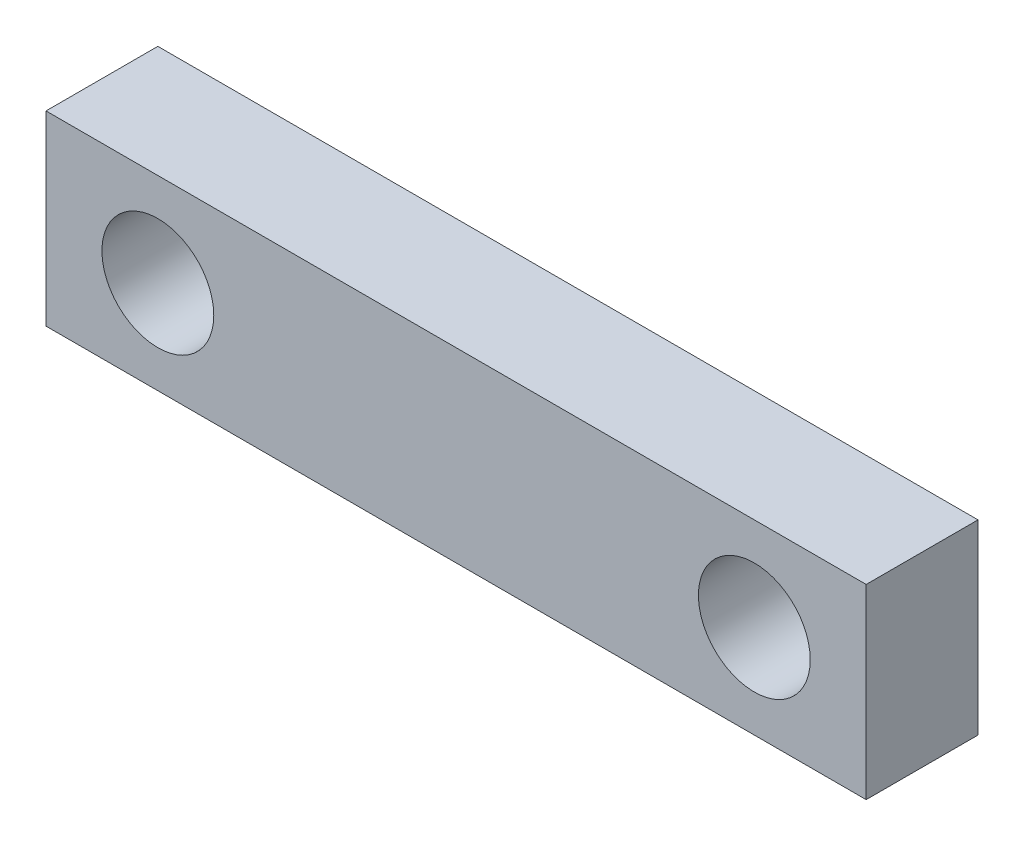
ISO-10303-21;
HEADER;
FILE_DESCRIPTION(('STEP AP214'),'2;1');
FILE_NAME('part.step','',(''),(''),'','','');
FILE_SCHEMA(('AUTOMOTIVE_DESIGN { 1 0 10303 214 1 1 1 1 }'));
ENDSEC;
DATA;
#1=APPLICATION_CONTEXT('core data for automotive mechanical design processes');
#2=APPLICATION_PROTOCOL_DEFINITION('international standard','automotive_design',2000,#1);
#3=PRODUCT_CONTEXT('',#1,'mechanical');
#4=PRODUCT('Part','Part','',(#3));
#5=PRODUCT_RELATED_PRODUCT_CATEGORY('part','',(#4));
#6=PRODUCT_DEFINITION_FORMATION('','',#4);
#7=PRODUCT_DEFINITION_CONTEXT('part definition',#1,'design');
#8=PRODUCT_DEFINITION('design','',#6,#7);
#9=PRODUCT_DEFINITION_SHAPE('','',#8);
#10=(LENGTH_UNIT() NAMED_UNIT(*) SI_UNIT(.MILLI.,.METRE.));
#11=(NAMED_UNIT(*) PLANE_ANGLE_UNIT() SI_UNIT($,.RADIAN.));
#12=(NAMED_UNIT(*) SI_UNIT($,.STERADIAN.) SOLID_ANGLE_UNIT());
#13=UNCERTAINTY_MEASURE_WITH_UNIT(LENGTH_MEASURE(1.E-05),#10,'distance_accuracy_value','');
#14=(GEOMETRIC_REPRESENTATION_CONTEXT(3) GLOBAL_UNCERTAINTY_ASSIGNED_CONTEXT((#13)) GLOBAL_UNIT_ASSIGNED_CONTEXT((#10,
#11,#12)) REPRESENTATION_CONTEXT('',''));
#15=CARTESIAN_POINT('',(0.,0.,0.));
#16=DIRECTION('',(0.,0.,1.));
#17=DIRECTION('',(1.,0.,0.));
#18=AXIS2_PLACEMENT_3D('',#15,#16,#17);
#19=CARTESIAN_POINT('',(0.,0.,15.));
#20=DIRECTION('',(1.,0.,0.));
#21=DIRECTION('',(0.,0.,-1.));
#22=AXIS2_PLACEMENT_3D('',#19,#20,#21);
#23=PLANE('',#22);
#24=DIRECTION('',(0.,-1.,0.));
#25=VECTOR('',#24,1.);
#26=CARTESIAN_POINT('',(0.,0.,0.));
#27=LINE('',#26,#25);
#28=CARTESIAN_POINT('',(0.,25.,0.));
#29=VERTEX_POINT('',#28);
#30=CARTESIAN_POINT('',(0.,0.,0.));
#31=VERTEX_POINT('',#30);
#32=EDGE_CURVE('E68',#29,#31,#27,.T.);
#33=ORIENTED_EDGE('',*,*,#32,.T.);
#34=DIRECTION('',(0.,0.,-1.));
#35=VECTOR('',#34,1.);
#36=CARTESIAN_POINT('',(0.,0.,15.));
#37=LINE('',#36,#35);
#38=CARTESIAN_POINT('',(0.,0.,15.));
#39=VERTEX_POINT('',#38);
#40=EDGE_CURVE('E11',#39,#31,#37,.T.);
#41=ORIENTED_EDGE('',*,*,#40,.F.);
#42=DIRECTION('',(0.,-1.,0.));
#43=VECTOR('',#42,1.);
#44=CARTESIAN_POINT('',(0.,0.,15.));
#45=LINE('',#44,#43);
#46=CARTESIAN_POINT('',(0.,25.,15.));
#47=VERTEX_POINT('',#46);
#48=EDGE_CURVE('E91',#47,#39,#45,.T.);
#49=ORIENTED_EDGE('',*,*,#48,.F.);
#50=DIRECTION('',(0.,0.,-1.));
#51=VECTOR('',#50,1.);
#52=CARTESIAN_POINT('',(0.,25.,15.));
#53=LINE('',#52,#51);
#54=EDGE_CURVE('E80',#47,#29,#53,.T.);
#55=ORIENTED_EDGE('',*,*,#54,.T.);
#56=EDGE_LOOP('',(#33,#41,#49,#55));
#57=FACE_BOUND('',#56,.T.);
#58=ADVANCED_FACE('F24',(#57),#23,.F.);
#59=CARTESIAN_POINT('',(0.,0.,15.));
#60=DIRECTION('',(0.,1.,0.));
#61=DIRECTION('',(0.,0.,1.));
#62=AXIS2_PLACEMENT_3D('',#59,#60,#61);
#63=PLANE('',#62);
#64=DIRECTION('',(1.,0.,0.));
#65=VECTOR('',#64,1.);
#66=CARTESIAN_POINT('',(0.,0.,0.));
#67=LINE('',#66,#65);
#68=CARTESIAN_POINT('',(110.,0.,0.));
#69=VERTEX_POINT('',#68);
#70=EDGE_CURVE('E64',#31,#69,#67,.T.);
#71=ORIENTED_EDGE('',*,*,#70,.T.);
#72=DIRECTION('',(0.,0.,-1.));
#73=VECTOR('',#72,1.);
#74=CARTESIAN_POINT('',(110.,0.,15.));
#75=LINE('',#74,#73);
#76=CARTESIAN_POINT('',(110.,0.,15.));
#77=VERTEX_POINT('',#76);
#78=EDGE_CURVE('E31',#77,#69,#75,.T.);
#79=ORIENTED_EDGE('',*,*,#78,.F.);
#80=DIRECTION('',(1.,0.,0.));
#81=VECTOR('',#80,1.);
#82=CARTESIAN_POINT('',(0.,0.,15.));
#83=LINE('',#82,#81);
#84=EDGE_CURVE('E76',#39,#77,#83,.T.);
#85=ORIENTED_EDGE('',*,*,#84,.F.);
#86=ORIENTED_EDGE('',*,*,#40,.T.);
#87=EDGE_LOOP('',(#71,#79,#85,#86));
#88=FACE_BOUND('',#87,.T.);
#89=ADVANCED_FACE('F75',(#88),#63,.F.);
#90=CARTESIAN_POINT('',(110.,0.,15.));
#91=DIRECTION('',(-1.,0.,0.));
#92=DIRECTION('',(0.,0.,1.));
#93=AXIS2_PLACEMENT_3D('',#90,#91,#92);
#94=PLANE('',#93);
#95=DIRECTION('',(0.,1.,0.));
#96=VECTOR('',#95,1.);
#97=CARTESIAN_POINT('',(110.,0.,0.));
#98=LINE('',#97,#96);
#99=CARTESIAN_POINT('',(110.,25.,0.));
#100=VERTEX_POINT('',#99);
#101=EDGE_CURVE('E69',#69,#100,#98,.T.);
#102=ORIENTED_EDGE('',*,*,#101,.T.);
#103=DIRECTION('',(0.,0.,-1.));
#104=VECTOR('',#103,1.);
#105=CARTESIAN_POINT('',(110.,25.,15.));
#106=LINE('',#105,#104);
#107=CARTESIAN_POINT('',(110.,25.,15.));
#108=VERTEX_POINT('',#107);
#109=EDGE_CURVE('E97',#108,#100,#106,.T.);
#110=ORIENTED_EDGE('',*,*,#109,.F.);
#111=DIRECTION('',(0.,1.,0.));
#112=VECTOR('',#111,1.);
#113=CARTESIAN_POINT('',(110.,0.,15.));
#114=LINE('',#113,#112);
#115=EDGE_CURVE('E43',#77,#108,#114,.T.);
#116=ORIENTED_EDGE('',*,*,#115,.F.);
#117=ORIENTED_EDGE('',*,*,#78,.T.);
#118=EDGE_LOOP('',(#102,#110,#116,#117));
#119=FACE_BOUND('',#118,.T.);
#120=ADVANCED_FACE('F100',(#119),#94,.F.);
#121=CARTESIAN_POINT('',(0.,25.,15.));
#122=DIRECTION('',(0.,-1.,0.));
#123=DIRECTION('',(0.,0.,-1.));
#124=AXIS2_PLACEMENT_3D('',#121,#122,#123);
#125=PLANE('',#124);
#126=DIRECTION('',(-1.,0.,0.));
#127=VECTOR('',#126,1.);
#128=CARTESIAN_POINT('',(0.,25.,0.));
#129=LINE('',#128,#127);
#130=EDGE_CURVE('E89',#100,#29,#129,.T.);
#131=ORIENTED_EDGE('',*,*,#130,.T.);
#132=ORIENTED_EDGE('',*,*,#54,.F.);
#133=DIRECTION('',(-1.,0.,0.));
#134=VECTOR('',#133,1.);
#135=CARTESIAN_POINT('',(0.,25.,15.));
#136=LINE('',#135,#134);
#137=EDGE_CURVE('E38',#108,#47,#136,.T.);
#138=ORIENTED_EDGE('',*,*,#137,.F.);
#139=ORIENTED_EDGE('',*,*,#109,.T.);
#140=EDGE_LOOP('',(#131,#132,#138,#139));
#141=FACE_BOUND('',#140,.T.);
#142=ADVANCED_FACE('F102',(#141),#125,.F.);
#143=CARTESIAN_POINT('',(0.,25.,15.));
#144=DIRECTION('',(0.,0.,-1.));
#145=DIRECTION('',(-1.,0.,0.));
#146=AXIS2_PLACEMENT_3D('',#143,#144,#145);
#147=PLANE('',#146);
#148=CARTESIAN_POINT('',(95.,12.5,15.));
#149=DIRECTION('',(0.,0.,1.));
#150=DIRECTION('',(1.,0.,0.));
#151=AXIS2_PLACEMENT_3D('',#148,#149,#150);
#152=CIRCLE('',#151,7.50000000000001);
#153=CARTESIAN_POINT('',(102.5,12.5,15.));
#154=VERTEX_POINT('',#153);
#155=EDGE_CURVE('E159',#154,#154,#152,.T.);
#156=ORIENTED_EDGE('',*,*,#155,.F.);
#157=EDGE_LOOP('',(#156));
#158=FACE_BOUND('',#157,.T.);
#159=CARTESIAN_POINT('',(15.,12.5,15.));
#160=DIRECTION('',(0.,0.,1.));
#161=DIRECTION('',(1.,0.,0.));
#162=AXIS2_PLACEMENT_3D('',#159,#160,#161);
#163=CIRCLE('',#162,7.5);
#164=CARTESIAN_POINT('',(22.5,12.5,15.));
#165=VERTEX_POINT('',#164);
#166=EDGE_CURVE('E84',#165,#165,#163,.T.);
#167=ORIENTED_EDGE('',*,*,#166,.F.);
#168=EDGE_LOOP('',(#167));
#169=FACE_BOUND('',#168,.T.);
#170=ORIENTED_EDGE('',*,*,#48,.T.);
#171=ORIENTED_EDGE('',*,*,#84,.T.);
#172=ORIENTED_EDGE('',*,*,#115,.T.);
#173=ORIENTED_EDGE('',*,*,#137,.T.);
#174=EDGE_LOOP('',(#170,#171,#172,#173));
#175=FACE_BOUND('',#174,.T.);
#176=ADVANCED_FACE('F103',(#158,#169,#175),#147,.F.);
#177=CARTESIAN_POINT('',(0.,25.,0.));
#178=DIRECTION('',(0.,0.,-1.));
#179=DIRECTION('',(-1.,0.,0.));
#180=AXIS2_PLACEMENT_3D('',#177,#178,#179);
#181=PLANE('',#180);
#182=CARTESIAN_POINT('',(95.,12.5,0.));
#183=DIRECTION('',(0.,0.,1.));
#184=DIRECTION('',(1.,0.,0.));
#185=AXIS2_PLACEMENT_3D('',#182,#183,#184);
#186=CIRCLE('',#185,7.50000000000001);
#187=CARTESIAN_POINT('',(102.5,12.5,0.));
#188=VERTEX_POINT('',#187);
#189=EDGE_CURVE('E157',#188,#188,#186,.T.);
#190=ORIENTED_EDGE('',*,*,#189,.T.);
#191=EDGE_LOOP('',(#190));
#192=FACE_BOUND('',#191,.T.);
#193=CARTESIAN_POINT('',(15.,12.5,0.));
#194=DIRECTION('',(0.,0.,1.));
#195=DIRECTION('',(1.,0.,0.));
#196=AXIS2_PLACEMENT_3D('',#193,#194,#195);
#197=CIRCLE('',#196,7.5);
#198=CARTESIAN_POINT('',(22.5,12.5,0.));
#199=VERTEX_POINT('',#198);
#200=EDGE_CURVE('E81',#199,#199,#197,.T.);
#201=ORIENTED_EDGE('',*,*,#200,.T.);
#202=EDGE_LOOP('',(#201));
#203=FACE_BOUND('',#202,.T.);
#204=ORIENTED_EDGE('',*,*,#32,.F.);
#205=ORIENTED_EDGE('',*,*,#130,.F.);
#206=ORIENTED_EDGE('',*,*,#101,.F.);
#207=ORIENTED_EDGE('',*,*,#70,.F.);
#208=EDGE_LOOP('',(#204,#205,#206,#207));
#209=FACE_BOUND('',#208,.T.);
#210=ADVANCED_FACE('F65',(#192,#203,#209),#181,.T.);
#211=CARTESIAN_POINT('',(15.,12.5,0.));
#212=DIRECTION('',(0.,0.,1.));
#213=DIRECTION('',(1.,0.,0.));
#214=AXIS2_PLACEMENT_3D('',#211,#212,#213);
#215=CYLINDRICAL_SURFACE('',#214,7.5);
#216=ORIENTED_EDGE('',*,*,#200,.F.);
#217=EDGE_LOOP('',(#216));
#218=FACE_BOUND('',#217,.T.);
#219=ORIENTED_EDGE('',*,*,#166,.T.);
#220=EDGE_LOOP('',(#219));
#221=FACE_BOUND('',#220,.T.);
#222=ADVANCED_FACE('F111',(#218,#221),#215,.F.);
#223=CARTESIAN_POINT('',(95.,12.5,0.));
#224=DIRECTION('',(0.,0.,1.));
#225=DIRECTION('',(1.,0.,0.));
#226=AXIS2_PLACEMENT_3D('',#223,#224,#225);
#227=CYLINDRICAL_SURFACE('',#226,7.50000000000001);
#228=ORIENTED_EDGE('',*,*,#189,.F.);
#229=EDGE_LOOP('',(#228));
#230=FACE_BOUND('',#229,.T.);
#231=ORIENTED_EDGE('',*,*,#155,.T.);
#232=EDGE_LOOP('',(#231));
#233=FACE_BOUND('',#232,.T.);
#234=ADVANCED_FACE('F144',(#230,#233),#227,.F.);
#235=CLOSED_SHELL('',(#58,#89,#120,#142,#176,#210,#222,#234));
#236=MANIFOLD_SOLID_BREP('B2',#235);
#237=ADVANCED_BREP_SHAPE_REPRESENTATION('',(#18,#236),#14);
#238=SHAPE_DEFINITION_REPRESENTATION(#9,#237);
ENDSEC;
END-ISO-10303-21;
